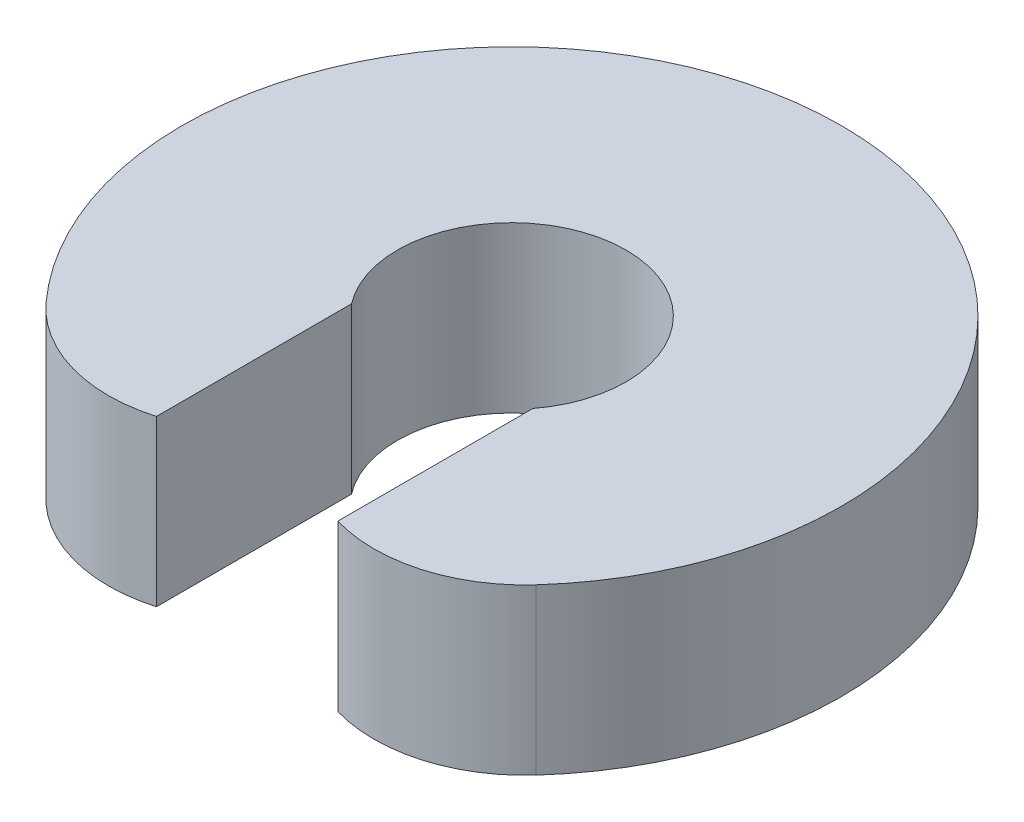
ISO-10303-21;
HEADER;
FILE_DESCRIPTION(('STEP AP214'),'2;1');
FILE_NAME('part.step','',(''),(''),'','','');
FILE_SCHEMA(('AUTOMOTIVE_DESIGN { 1 0 10303 214 1 1 1 1 }'));
ENDSEC;
DATA;
#1=APPLICATION_CONTEXT('core data for automotive mechanical design processes');
#2=APPLICATION_PROTOCOL_DEFINITION('international standard','automotive_design',2000,#1);
#3=PRODUCT_CONTEXT('',#1,'mechanical');
#4=PRODUCT('Part','Part','',(#3));
#5=PRODUCT_RELATED_PRODUCT_CATEGORY('part','',(#4));
#6=PRODUCT_DEFINITION_FORMATION('','',#4);
#7=PRODUCT_DEFINITION_CONTEXT('part definition',#1,'design');
#8=PRODUCT_DEFINITION('design','',#6,#7);
#9=PRODUCT_DEFINITION_SHAPE('','',#8);
#10=(LENGTH_UNIT() NAMED_UNIT(*) SI_UNIT(.MILLI.,.METRE.));
#11=(NAMED_UNIT(*) PLANE_ANGLE_UNIT() SI_UNIT($,.RADIAN.));
#12=(NAMED_UNIT(*) SI_UNIT($,.STERADIAN.) SOLID_ANGLE_UNIT());
#13=UNCERTAINTY_MEASURE_WITH_UNIT(LENGTH_MEASURE(1.E-05),#10,'distance_accuracy_value','');
#14=(GEOMETRIC_REPRESENTATION_CONTEXT(3) GLOBAL_UNCERTAINTY_ASSIGNED_CONTEXT((#13)) GLOBAL_UNIT_ASSIGNED_CONTEXT((#10,
#11,#12)) REPRESENTATION_CONTEXT('',''));
#15=CARTESIAN_POINT('',(0.,0.,0.));
#16=DIRECTION('',(0.,0.,1.));
#17=DIRECTION('',(1.,0.,0.));
#18=AXIS2_PLACEMENT_3D('',#15,#16,#17);
#19=CARTESIAN_POINT('',(0.,0.,0.));
#20=DIRECTION('',(0.,1.,0.));
#21=DIRECTION('',(0.,0.,1.));
#22=AXIS2_PLACEMENT_3D('',#19,#20,#21);
#23=PLANE('',#22);
#24=DIRECTION('',(0.,0.,-1.));
#25=VECTOR('',#24,1.);
#26=CARTESIAN_POINT('',(165.,0.,0.));
#27=LINE('',#26,#25);
#28=CARTESIAN_POINT('',(165.,0.,481.606374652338));
#29=VERTEX_POINT('',#28);
#30=CARTESIAN_POINT('',(165.,0.,126.645173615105));
#31=VERTEX_POINT('',#30);
#32=EDGE_CURVE('E66',#29,#31,#27,.T.);
#33=ORIENTED_EDGE('',*,*,#32,.T.);
#34=CARTESIAN_POINT('',(0.,0.,0.));
#35=DIRECTION('',(0.,-1.,0.));
#36=DIRECTION('',(0.,0.,-1.));
#37=AXIS2_PLACEMENT_3D('',#34,#35,#36);
#38=CIRCLE('',#37,208.);
#39=CARTESIAN_POINT('',(-165.,0.,126.645173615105));
#40=VERTEX_POINT('',#39);
#41=EDGE_CURVE('E106',#31,#40,#38,.F.);
#42=ORIENTED_EDGE('',*,*,#41,.T.);
#43=DIRECTION('',(0.,0.,-1.));
#44=VECTOR('',#43,1.);
#45=CARTESIAN_POINT('',(-165.,0.,0.));
#46=LINE('',#45,#44);
#47=CARTESIAN_POINT('',(-165.,0.,481.606374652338));
#48=VERTEX_POINT('',#47);
#49=EDGE_CURVE('E96',#48,#40,#46,.T.);
#50=ORIENTED_EDGE('',*,*,#49,.F.);
#51=CARTESIAN_POINT('',(-241.522068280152,0.,217.46744706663));
#52=DIRECTION('',(0.,-1.,0.));
#53=DIRECTION('',(0.,0.,-1.));
#54=AXIS2_PLACEMENT_3D('',#51,#52,#53);
#55=CIRCLE('',#54,275.);
#56=CARTESIAN_POINT('',(-445.886895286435,0.,401.478363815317));
#57=VERTEX_POINT('',#56);
#58=EDGE_CURVE('E75',#57,#48,#55,.F.);
#59=ORIENTED_EDGE('',*,*,#58,.F.);
#60=CARTESIAN_POINT('',(0.,0.,0.));
#61=DIRECTION('',(0.,-1.,0.));
#62=DIRECTION('',(0.,0.,-1.));
#63=AXIS2_PLACEMENT_3D('',#60,#61,#62);
#64=CIRCLE('',#63,600.);
#65=CARTESIAN_POINT('',(445.886895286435,0.,401.478363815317));
#66=VERTEX_POINT('',#65);
#67=EDGE_CURVE('E71',#66,#57,#64,.F.);
#68=ORIENTED_EDGE('',*,*,#67,.F.);
#69=CARTESIAN_POINT('',(241.522068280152,0.,217.46744706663));
#70=DIRECTION('',(0.,-1.,0.));
#71=DIRECTION('',(0.,0.,-1.));
#72=AXIS2_PLACEMENT_3D('',#69,#70,#71);
#73=CIRCLE('',#72,275.);
#74=EDGE_CURVE('E20',#29,#66,#73,.F.);
#75=ORIENTED_EDGE('',*,*,#74,.F.);
#76=EDGE_LOOP('',(#33,#42,#50,#59,#68,#75));
#77=FACE_BOUND('',#76,.T.);
#78=ADVANCED_FACE('F17',(#77),#23,.F.);
#79=CARTESIAN_POINT('',(165.,200.,0.));
#80=DIRECTION('',(1.,0.,0.));
#81=DIRECTION('',(0.,0.,-1.));
#82=AXIS2_PLACEMENT_3D('',#79,#80,#81);
#83=PLANE('',#82);
#84=DIRECTION('',(0.,0.,1.));
#85=VECTOR('',#84,1.);
#86=CARTESIAN_POINT('',(165.,300.,0.));
#87=LINE('',#86,#85);
#88=CARTESIAN_POINT('',(165.,300.,126.645173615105));
#89=VERTEX_POINT('',#88);
#90=CARTESIAN_POINT('',(165.,300.,481.606374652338));
#91=VERTEX_POINT('',#90);
#92=EDGE_CURVE('E105',#89,#91,#87,.T.);
#93=ORIENTED_EDGE('',*,*,#92,.F.);
#94=DIRECTION('',(0.,-1.,0.));
#95=VECTOR('',#94,1.);
#96=CARTESIAN_POINT('',(165.,200.,126.645173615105));
#97=LINE('',#96,#95);
#98=EDGE_CURVE('E108',#89,#31,#97,.T.);
#99=ORIENTED_EDGE('',*,*,#98,.T.);
#100=ORIENTED_EDGE('',*,*,#32,.F.);
#101=DIRECTION('',(0.,-1.,0.));
#102=VECTOR('',#101,1.);
#103=CARTESIAN_POINT('',(165.,200.,481.606374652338));
#104=LINE('',#103,#102);
#105=EDGE_CURVE('E86',#91,#29,#104,.T.);
#106=ORIENTED_EDGE('',*,*,#105,.F.);
#107=EDGE_LOOP('',(#93,#99,#100,#106));
#108=FACE_BOUND('',#107,.T.);
#109=ADVANCED_FACE('F124',(#108),#83,.F.);
#110=CARTESIAN_POINT('',(241.522068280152,200.,217.46744706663));
#111=DIRECTION('',(0.,-1.,0.));
#112=DIRECTION('',(0.,0.,-1.));
#113=AXIS2_PLACEMENT_3D('',#110,#111,#112);
#114=CYLINDRICAL_SURFACE('',#113,275.);
#115=ORIENTED_EDGE('',*,*,#74,.T.);
#116=DIRECTION('',(0.,-1.,0.));
#117=VECTOR('',#116,1.);
#118=CARTESIAN_POINT('',(445.886895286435,200.,401.478363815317));
#119=LINE('',#118,#117);
#120=CARTESIAN_POINT('',(445.886895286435,300.,401.478363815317));
#121=VERTEX_POINT('',#120);
#122=EDGE_CURVE('E81',#121,#66,#119,.T.);
#123=ORIENTED_EDGE('',*,*,#122,.F.);
#124=CARTESIAN_POINT('',(241.522068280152,300.,217.46744706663));
#125=DIRECTION('',(0.,-1.,0.));
#126=DIRECTION('',(0.,0.,-1.));
#127=AXIS2_PLACEMENT_3D('',#124,#125,#126);
#128=CIRCLE('',#127,275.);
#129=EDGE_CURVE('E103',#91,#121,#128,.F.);
#130=ORIENTED_EDGE('',*,*,#129,.F.);
#131=ORIENTED_EDGE('',*,*,#105,.T.);
#132=EDGE_LOOP('',(#115,#123,#130,#131));
#133=FACE_BOUND('',#132,.T.);
#134=ADVANCED_FACE('F83',(#133),#114,.T.);
#135=CARTESIAN_POINT('',(0.,200.,0.));
#136=DIRECTION('',(0.,-1.,0.));
#137=DIRECTION('',(0.,0.,-1.));
#138=AXIS2_PLACEMENT_3D('',#135,#136,#137);
#139=CYLINDRICAL_SURFACE('',#138,600.);
#140=ORIENTED_EDGE('',*,*,#67,.T.);
#141=DIRECTION('',(0.,-1.,0.));
#142=VECTOR('',#141,1.);
#143=CARTESIAN_POINT('',(-445.886895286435,200.,401.478363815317));
#144=LINE('',#143,#142);
#145=CARTESIAN_POINT('',(-445.886895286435,300.,401.478363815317));
#146=VERTEX_POINT('',#145);
#147=EDGE_CURVE('E80',#146,#57,#144,.T.);
#148=ORIENTED_EDGE('',*,*,#147,.F.);
#149=CARTESIAN_POINT('',(0.,300.,0.));
#150=DIRECTION('',(0.,-1.,0.));
#151=DIRECTION('',(0.,0.,-1.));
#152=AXIS2_PLACEMENT_3D('',#149,#150,#151);
#153=CIRCLE('',#152,600.);
#154=EDGE_CURVE('E88',#121,#146,#153,.F.);
#155=ORIENTED_EDGE('',*,*,#154,.F.);
#156=ORIENTED_EDGE('',*,*,#122,.T.);
#157=EDGE_LOOP('',(#140,#148,#155,#156));
#158=FACE_BOUND('',#157,.T.);
#159=ADVANCED_FACE('F87',(#158),#139,.T.);
#160=CARTESIAN_POINT('',(-241.522068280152,200.,217.46744706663));
#161=DIRECTION('',(0.,-1.,0.));
#162=DIRECTION('',(0.,0.,-1.));
#163=AXIS2_PLACEMENT_3D('',#160,#161,#162);
#164=CYLINDRICAL_SURFACE('',#163,275.);
#165=ORIENTED_EDGE('',*,*,#58,.T.);
#166=DIRECTION('',(0.,1.,0.));
#167=VECTOR('',#166,1.);
#168=CARTESIAN_POINT('',(-165.,200.,481.606374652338));
#169=LINE('',#168,#167);
#170=CARTESIAN_POINT('',(-165.,300.,481.606374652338));
#171=VERTEX_POINT('',#170);
#172=EDGE_CURVE('E97',#171,#48,#169,.F.);
#173=ORIENTED_EDGE('',*,*,#172,.F.);
#174=CARTESIAN_POINT('',(-241.522068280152,300.,217.46744706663));
#175=DIRECTION('',(0.,-1.,0.));
#176=DIRECTION('',(0.,0.,-1.));
#177=AXIS2_PLACEMENT_3D('',#174,#175,#176);
#178=CIRCLE('',#177,275.);
#179=EDGE_CURVE('E99',#146,#171,#178,.F.);
#180=ORIENTED_EDGE('',*,*,#179,.F.);
#181=ORIENTED_EDGE('',*,*,#147,.T.);
#182=EDGE_LOOP('',(#165,#173,#180,#181));
#183=FACE_BOUND('',#182,.T.);
#184=ADVANCED_FACE('F112',(#183),#164,.T.);
#185=CARTESIAN_POINT('',(-165.,200.,0.));
#186=DIRECTION('',(1.,0.,0.));
#187=DIRECTION('',(0.,0.,-1.));
#188=AXIS2_PLACEMENT_3D('',#185,#186,#187);
#189=PLANE('',#188);
#190=ORIENTED_EDGE('',*,*,#49,.T.);
#191=DIRECTION('',(0.,-1.,0.));
#192=VECTOR('',#191,1.);
#193=CARTESIAN_POINT('',(-165.,200.,126.645173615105));
#194=LINE('',#193,#192);
#195=CARTESIAN_POINT('',(-165.,300.,126.645173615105));
#196=VERTEX_POINT('',#195);
#197=EDGE_CURVE('E35',#40,#196,#194,.F.);
#198=ORIENTED_EDGE('',*,*,#197,.T.);
#199=DIRECTION('',(0.,0.,1.));
#200=VECTOR('',#199,1.);
#201=CARTESIAN_POINT('',(-165.,300.,0.));
#202=LINE('',#201,#200);
#203=EDGE_CURVE('E26',#171,#196,#202,.F.);
#204=ORIENTED_EDGE('',*,*,#203,.F.);
#205=ORIENTED_EDGE('',*,*,#172,.T.);
#206=EDGE_LOOP('',(#190,#198,#204,#205));
#207=FACE_BOUND('',#206,.T.);
#208=ADVANCED_FACE('F127',(#207),#189,.T.);
#209=CARTESIAN_POINT('',(0.,200.,0.));
#210=DIRECTION('',(0.,-1.,0.));
#211=DIRECTION('',(0.,0.,-1.));
#212=AXIS2_PLACEMENT_3D('',#209,#210,#211);
#213=CYLINDRICAL_SURFACE('',#212,208.);
#214=ORIENTED_EDGE('',*,*,#98,.F.);
#215=CARTESIAN_POINT('',(0.,300.,0.));
#216=DIRECTION('',(0.,-1.,0.));
#217=DIRECTION('',(0.,0.,-1.));
#218=AXIS2_PLACEMENT_3D('',#215,#216,#217);
#219=CIRCLE('',#218,208.);
#220=EDGE_CURVE('E10',#196,#89,#219,.T.);
#221=ORIENTED_EDGE('',*,*,#220,.F.);
#222=ORIENTED_EDGE('',*,*,#197,.F.);
#223=ORIENTED_EDGE('',*,*,#41,.F.);
#224=EDGE_LOOP('',(#214,#221,#222,#223));
#225=FACE_BOUND('',#224,.T.);
#226=ADVANCED_FACE('F126',(#225),#213,.F.);
#227=CARTESIAN_POINT('',(0.,300.,0.));
#228=DIRECTION('',(0.,1.,0.));
#229=DIRECTION('',(0.,0.,1.));
#230=AXIS2_PLACEMENT_3D('',#227,#228,#229);
#231=PLANE('',#230);
#232=ORIENTED_EDGE('',*,*,#220,.T.);
#233=ORIENTED_EDGE('',*,*,#92,.T.);
#234=ORIENTED_EDGE('',*,*,#129,.T.);
#235=ORIENTED_EDGE('',*,*,#154,.T.);
#236=ORIENTED_EDGE('',*,*,#179,.T.);
#237=ORIENTED_EDGE('',*,*,#203,.T.);
#238=EDGE_LOOP('',(#232,#233,#234,#235,#236,#237));
#239=FACE_BOUND('',#238,.T.);
#240=ADVANCED_FACE('F115',(#239),#231,.T.);
#241=CLOSED_SHELL('',(#78,#109,#134,#159,#184,#208,#226,#240));
#242=MANIFOLD_SOLID_BREP('B1',#241);
#243=ADVANCED_BREP_SHAPE_REPRESENTATION('',(#18,#242),#14);
#244=SHAPE_DEFINITION_REPRESENTATION(#9,#243);
ENDSEC;
END-ISO-10303-21;
